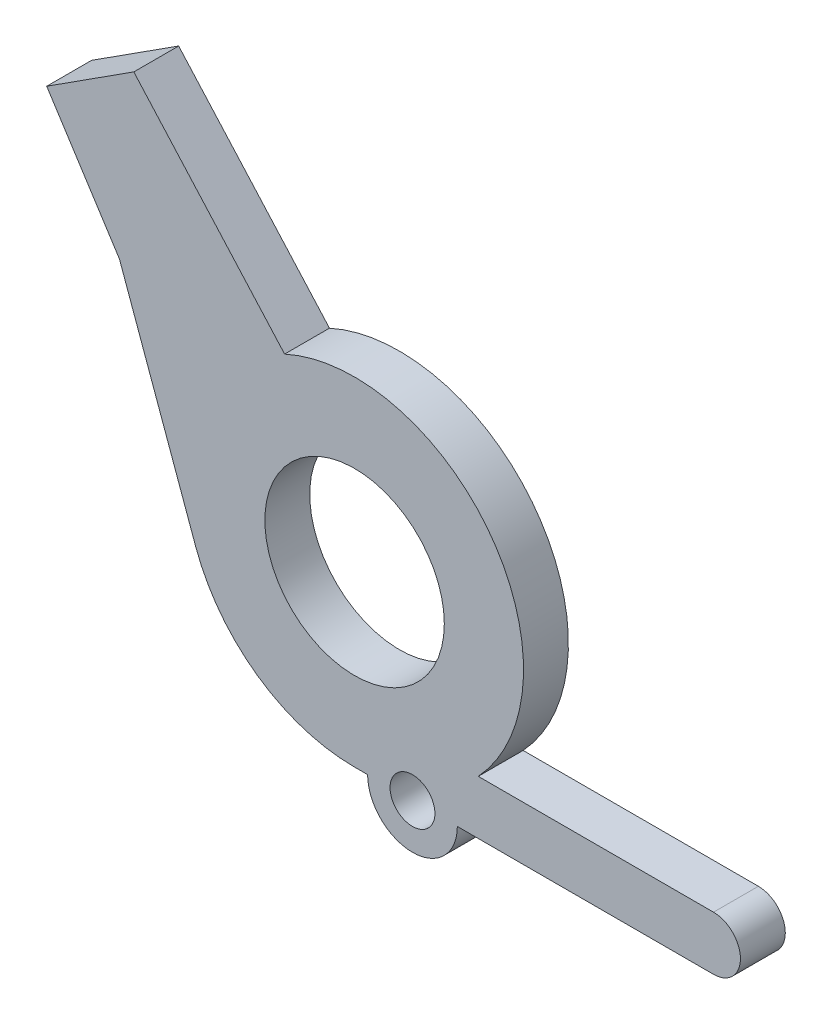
from build123d import *

# Parameters (mm, degrees)
ESQUISSE1_R             = 2
BASE_EXTRUSION_DEPTH    = 1
ESQUISSE2_R             = 1
BOSS_EXTRU_2_DEPTH      = 1
ESQUISSE3_R             = 0.5
ENL_V_MAT_EXTRU_1_DEPTH = 12.256281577


with BuildPart() as part:
    # Esquisse1 → Base-Extrusion (new body)
    with BuildSketch(Plane.XY):
        with BuildLine():
            Line((0, -3.765594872), (8, -3.765594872))
            ThreePointArc((8, -3.765594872), (8.6, -3.165594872), (8, -2.565594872))
            Line((8, -2.565594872), (2.756343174, -2.565594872))
            ThreePointArc((2.756343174, -2.565594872), (3.05554564, 2.200760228), (-1.560012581, 3.427253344))
            Line((-1.560012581, 3.427253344), (-4.921212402, 7.193321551))
            Line((-4.921212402, 7.193321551), (-6.862589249, 5.946126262))
            Line((-6.862589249, 5.946126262), (-5.241082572, 3.42209851))
            Line((-5.241082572, 3.42209851), (-3.541328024, -1.280117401))
            ThreePointArc((-3.541328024, -1.280117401), (-2.163250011, -3.082215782), (0, -3.765594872))
        make_face()
        Circle(ESQUISSE1_R, mode=Mode.SUBTRACT)
    extrude(amount=BASE_EXTRUSION_DEPTH)

    # Esquisse2 → Boss.-Extru.2 (add)
    with BuildSketch(Plane.XY.offset(1)):
        with Locations((1.290132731, -3.765594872)):
            Circle(ESQUISSE2_R)
    extrude(amount=-BOSS_EXTRU_2_DEPTH)

    # Esquisse3 → Enl_v. mat.-Extru.1 (cut, through all)
    with BuildSketch(Plane.XY.offset(1)):
        with Locations((1.290132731, -3.765594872)):
            Circle(ESQUISSE3_R)
    extrude(amount=-ENL_V_MAT_EXTRU_1_DEPTH, mode=Mode.SUBTRACT)


solid = part.part
